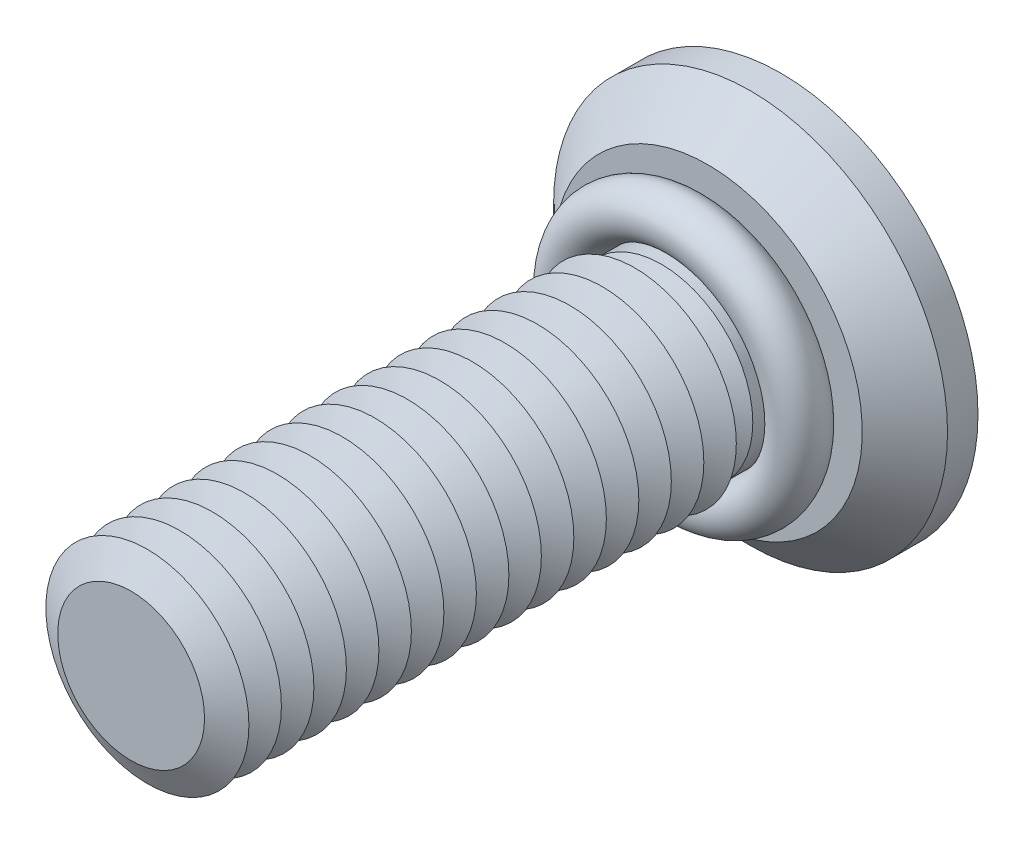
ISO-10303-21;
HEADER;
FILE_DESCRIPTION(('STEP AP214'),'2;1');
FILE_NAME('part.step','',(''),(''),'','','');
FILE_SCHEMA(('AUTOMOTIVE_DESIGN { 1 0 10303 214 1 1 1 1 }'));
ENDSEC;
DATA;
#1=APPLICATION_CONTEXT('core data for automotive mechanical design processes');
#2=APPLICATION_PROTOCOL_DEFINITION('international standard','automotive_design',2000,#1);
#3=PRODUCT_CONTEXT('',#1,'mechanical');
#4=PRODUCT('Part','Part','',(#3));
#5=PRODUCT_RELATED_PRODUCT_CATEGORY('part','',(#4));
#6=PRODUCT_DEFINITION_FORMATION('','',#4);
#7=PRODUCT_DEFINITION_CONTEXT('part definition',#1,'design');
#8=PRODUCT_DEFINITION('design','',#6,#7);
#9=PRODUCT_DEFINITION_SHAPE('','',#8);
#10=(LENGTH_UNIT() NAMED_UNIT(*) SI_UNIT(.MILLI.,.METRE.));
#11=(NAMED_UNIT(*) PLANE_ANGLE_UNIT() SI_UNIT($,.RADIAN.));
#12=(NAMED_UNIT(*) SI_UNIT($,.STERADIAN.) SOLID_ANGLE_UNIT());
#13=UNCERTAINTY_MEASURE_WITH_UNIT(LENGTH_MEASURE(1.E-05),#10,'distance_accuracy_value','');
#14=(GEOMETRIC_REPRESENTATION_CONTEXT(3) GLOBAL_UNCERTAINTY_ASSIGNED_CONTEXT((#13)) GLOBAL_UNIT_ASSIGNED_CONTEXT((#10,
#11,#12)) REPRESENTATION_CONTEXT('',''));
#15=CARTESIAN_POINT('',(0.,0.,0.));
#16=DIRECTION('',(0.,0.,1.));
#17=DIRECTION('',(1.,0.,0.));
#18=AXIS2_PLACEMENT_3D('',#15,#16,#17);
#19=CARTESIAN_POINT('',(0.,0.,2.4));
#20=DIRECTION('',(0.,0.,1.));
#21=DIRECTION('',(1.,0.,0.));
#22=AXIS2_PLACEMENT_3D('',#19,#20,#21);
#23=TOROIDAL_SURFACE('',#22,2.85,0.6);
#24=CARTESIAN_POINT('',(0.,2.85,2.4));
#25=DIRECTION('',(1.,0.,0.));
#26=DIRECTION('',(0.,0.,-1.));
#27=AXIS2_PLACEMENT_3D('',#24,#25,#26);
#28=CIRCLE('',#27,0.6);
#29=CARTESIAN_POINT('',(0.,3.45,2.4));
#30=VERTEX_POINT('',#29);
#31=EDGE_CURVE('P0_E10',#30,#30,#28,.T.);
#32=CARTESIAN_POINT('',(0.,0.,2.4));
#33=DIRECTION('',(0.,0.,1.));
#34=DIRECTION('',(1.,0.,0.));
#35=AXIS2_PLACEMENT_3D('',#32,#33,#34);
#36=CIRCLE('',#35,3.45);
#37=EDGE_CURVE('',#30,#30,#36,.T.);
#38=ORIENTED_EDGE('',*,*,#31,.F.);
#39=ORIENTED_EDGE('',*,*,#31,.T.);
#40=ORIENTED_EDGE('',*,*,#37,.T.);
#41=ORIENTED_EDGE('',*,*,#37,.F.);
#42=EDGE_LOOP('',(#38,#40,#39,#41));
#43=FACE_BOUND('',#42,.T.);
#44=ADVANCED_FACE('P0_F14',(#43),#23,.T.);
#45=CLOSED_SHELL('',(#44));
#46=MANIFOLD_SOLID_BREP('P0_B1',#45);
#47=CARTESIAN_POINT('',(0.,0.,12.));
#48=DIRECTION('',(0.,0.,-1.));
#49=DIRECTION('',(-1.,0.,0.));
#50=AXIS2_PLACEMENT_3D('',#47,#48,#49);
#51=CONICAL_SURFACE('',#50,1.80717967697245,1.0471975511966);
#52=CARTESIAN_POINT('',(0.,0.,11.6));
#53=DIRECTION('',(0.,0.,1.));
#54=DIRECTION('',(1.,0.,0.));
#55=AXIS2_PLACEMENT_3D('',#52,#53,#54);
#56=CIRCLE('',#55,2.5);
#57=CARTESIAN_POINT('',(2.5,0.,11.6));
#58=VERTEX_POINT('',#57);
#59=EDGE_CURVE('P1_E324',#58,#58,#56,.T.);
#60=ORIENTED_EDGE('',*,*,#59,.T.);
#61=EDGE_LOOP('',(#60));
#62=FACE_BOUND('',#61,.T.);
#63=CARTESIAN_POINT('',(0.,0.,12.));
#64=DIRECTION('',(0.,0.,1.));
#65=DIRECTION('',(1.,0.,0.));
#66=AXIS2_PLACEMENT_3D('',#63,#64,#65);
#67=CIRCLE('',#66,1.80717967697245);
#68=CARTESIAN_POINT('',(1.80717967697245,0.,12.));
#69=VERTEX_POINT('',#68);
#70=EDGE_CURVE('P1_E321',#69,#69,#67,.T.);
#71=ORIENTED_EDGE('',*,*,#70,.F.);
#72=EDGE_LOOP('',(#71));
#73=FACE_BOUND('',#72,.T.);
#74=ADVANCED_FACE('P1_F15',(#62,#73),#51,.T.);
#75=CARTESIAN_POINT('',(0.,0.,12.4));
#76=DIRECTION('',(0.,0.,1.));
#77=DIRECTION('',(1.,0.,0.));
#78=AXIS2_PLACEMENT_3D('',#75,#76,#77);
#79=CONICAL_SURFACE('',#78,2.5,1.0471975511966);
#80=ORIENTED_EDGE('',*,*,#70,.T.);
#81=EDGE_LOOP('',(#80));
#82=FACE_BOUND('',#81,.T.);
#83=CARTESIAN_POINT('',(0.,0.,12.4));
#84=DIRECTION('',(0.,0.,1.));
#85=DIRECTION('',(1.,0.,0.));
#86=AXIS2_PLACEMENT_3D('',#83,#84,#85);
#87=CIRCLE('',#86,2.5);
#88=CARTESIAN_POINT('',(2.5,0.,12.4));
#89=VERTEX_POINT('',#88);
#90=EDGE_CURVE('P1_E318',#89,#89,#87,.T.);
#91=ORIENTED_EDGE('',*,*,#90,.F.);
#92=EDGE_LOOP('',(#91));
#93=FACE_BOUND('',#92,.T.);
#94=ADVANCED_FACE('P1_F245',(#82,#93),#79,.T.);
#95=CARTESIAN_POINT('',(0.,0.,16.));
#96=DIRECTION('',(0.,0.,1.));
#97=DIRECTION('',(1.,0.,0.));
#98=AXIS2_PLACEMENT_3D('',#95,#96,#97);
#99=PLANE('',#98);
#100=CARTESIAN_POINT('',(0.,0.,16.));
#101=DIRECTION('',(0.,0.,1.));
#102=DIRECTION('',(1.,0.,0.));
#103=AXIS2_PLACEMENT_3D('',#100,#101,#102);
#104=CIRCLE('',#103,1.80717967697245);
#105=CARTESIAN_POINT('',(1.80717967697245,0.,16.));
#106=VERTEX_POINT('',#105);
#107=EDGE_CURVE('P1_E131',#106,#106,#104,.T.);
#108=ORIENTED_EDGE('',*,*,#107,.T.);
#109=EDGE_LOOP('',(#108));
#110=FACE_BOUND('',#109,.T.);
#111=ADVANCED_FACE('P1_F251',(#110),#99,.T.);
#112=CARTESIAN_POINT('',(0.,0.,16.));
#113=DIRECTION('',(0.,0.,-1.));
#114=DIRECTION('',(-1.,0.,0.));
#115=AXIS2_PLACEMENT_3D('',#112,#113,#114);
#116=CONICAL_SURFACE('',#115,1.80717967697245,1.0471975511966);
#117=CARTESIAN_POINT('',(0.,0.,15.6));
#118=DIRECTION('',(0.,0.,1.));
#119=DIRECTION('',(1.,0.,0.));
#120=AXIS2_PLACEMENT_3D('',#117,#118,#119);
#121=CIRCLE('',#120,2.5);
#122=CARTESIAN_POINT('',(2.5,0.,15.6));
#123=VERTEX_POINT('',#122);
#124=EDGE_CURVE('P1_E133',#123,#123,#121,.T.);
#125=ORIENTED_EDGE('',*,*,#124,.T.);
#126=EDGE_LOOP('',(#125));
#127=FACE_BOUND('',#126,.T.);
#128=ORIENTED_EDGE('',*,*,#107,.F.);
#129=EDGE_LOOP('',(#128));
#130=FACE_BOUND('',#129,.T.);
#131=ADVANCED_FACE('P1_F196',(#127,#130),#116,.T.);
#132=CARTESIAN_POINT('',(0.,0.,15.6));
#133=DIRECTION('',(0.,0.,1.));
#134=DIRECTION('',(1.,0.,0.));
#135=AXIS2_PLACEMENT_3D('',#132,#133,#134);
#136=CONICAL_SURFACE('',#135,2.5,1.0471975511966);
#137=CARTESIAN_POINT('',(0.,0.,15.2));
#138=DIRECTION('',(0.,0.,1.));
#139=DIRECTION('',(1.,0.,0.));
#140=AXIS2_PLACEMENT_3D('',#137,#138,#139);
#141=CIRCLE('',#140,1.80717967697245);
#142=CARTESIAN_POINT('',(1.80717967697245,0.,15.2));
#143=VERTEX_POINT('',#142);
#144=EDGE_CURVE('P1_E297',#143,#143,#141,.T.);
#145=ORIENTED_EDGE('',*,*,#144,.T.);
#146=EDGE_LOOP('',(#145));
#147=FACE_BOUND('',#146,.T.);
#148=ORIENTED_EDGE('',*,*,#124,.F.);
#149=EDGE_LOOP('',(#148));
#150=FACE_BOUND('',#149,.T.);
#151=ADVANCED_FACE('P1_F284',(#147,#150),#136,.T.);
#152=CARTESIAN_POINT('',(0.,0.,15.2));
#153=DIRECTION('',(0.,0.,-1.));
#154=DIRECTION('',(-1.,0.,0.));
#155=AXIS2_PLACEMENT_3D('',#152,#153,#154);
#156=CONICAL_SURFACE('',#155,1.80717967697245,1.0471975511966);
#157=CARTESIAN_POINT('',(0.,0.,14.8));
#158=DIRECTION('',(0.,0.,1.));
#159=DIRECTION('',(1.,0.,0.));
#160=AXIS2_PLACEMENT_3D('',#157,#158,#159);
#161=CIRCLE('',#160,2.5);
#162=CARTESIAN_POINT('',(2.5,0.,14.8));
#163=VERTEX_POINT('',#162);
#164=EDGE_CURVE('P1_E294',#163,#163,#161,.T.);
#165=ORIENTED_EDGE('',*,*,#164,.T.);
#166=EDGE_LOOP('',(#165));
#167=FACE_BOUND('',#166,.T.);
#168=ORIENTED_EDGE('',*,*,#144,.F.);
#169=EDGE_LOOP('',(#168));
#170=FACE_BOUND('',#169,.T.);
#171=ADVANCED_FACE('P1_F279',(#167,#170),#156,.T.);
#172=CARTESIAN_POINT('',(0.,0.,14.8));
#173=DIRECTION('',(0.,0.,1.));
#174=DIRECTION('',(1.,0.,0.));
#175=AXIS2_PLACEMENT_3D('',#172,#173,#174);
#176=CONICAL_SURFACE('',#175,2.5,1.0471975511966);
#177=CARTESIAN_POINT('',(0.,0.,14.4));
#178=DIRECTION('',(0.,0.,1.));
#179=DIRECTION('',(1.,0.,0.));
#180=AXIS2_PLACEMENT_3D('',#177,#178,#179);
#181=CIRCLE('',#180,1.80717967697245);
#182=CARTESIAN_POINT('',(1.80717967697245,0.,14.4));
#183=VERTEX_POINT('',#182);
#184=EDGE_CURVE('P1_E301',#183,#183,#181,.T.);
#185=ORIENTED_EDGE('',*,*,#184,.T.);
#186=EDGE_LOOP('',(#185));
#187=FACE_BOUND('',#186,.T.);
#188=ORIENTED_EDGE('',*,*,#164,.F.);
#189=EDGE_LOOP('',(#188));
#190=FACE_BOUND('',#189,.T.);
#191=ADVANCED_FACE('P1_F276',(#187,#190),#176,.T.);
#192=CARTESIAN_POINT('',(0.,0.,14.4));
#193=DIRECTION('',(0.,0.,-1.));
#194=DIRECTION('',(-1.,0.,0.));
#195=AXIS2_PLACEMENT_3D('',#192,#193,#194);
#196=CONICAL_SURFACE('',#195,1.80717967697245,1.0471975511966);
#197=CARTESIAN_POINT('',(0.,0.,14.));
#198=DIRECTION('',(0.,0.,1.));
#199=DIRECTION('',(1.,0.,0.));
#200=AXIS2_PLACEMENT_3D('',#197,#198,#199);
#201=CIRCLE('',#200,2.5);
#202=CARTESIAN_POINT('',(2.5,0.,14.));
#203=VERTEX_POINT('',#202);
#204=EDGE_CURVE('P1_E306',#203,#203,#201,.T.);
#205=ORIENTED_EDGE('',*,*,#204,.T.);
#206=EDGE_LOOP('',(#205));
#207=FACE_BOUND('',#206,.T.);
#208=ORIENTED_EDGE('',*,*,#184,.F.);
#209=EDGE_LOOP('',(#208));
#210=FACE_BOUND('',#209,.T.);
#211=ADVANCED_FACE('P1_F271',(#207,#210),#196,.T.);
#212=CARTESIAN_POINT('',(0.,0.,14.));
#213=DIRECTION('',(0.,0.,1.));
#214=DIRECTION('',(1.,0.,0.));
#215=AXIS2_PLACEMENT_3D('',#212,#213,#214);
#216=CONICAL_SURFACE('',#215,2.5,1.0471975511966);
#217=CARTESIAN_POINT('',(0.,0.,13.6));
#218=DIRECTION('',(0.,0.,1.));
#219=DIRECTION('',(1.,0.,0.));
#220=AXIS2_PLACEMENT_3D('',#217,#218,#219);
#221=CIRCLE('',#220,1.80717967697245);
#222=CARTESIAN_POINT('',(1.80717967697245,0.,13.6));
#223=VERTEX_POINT('',#222);
#224=EDGE_CURVE('P1_E309',#223,#223,#221,.T.);
#225=ORIENTED_EDGE('',*,*,#224,.T.);
#226=EDGE_LOOP('',(#225));
#227=FACE_BOUND('',#226,.T.);
#228=ORIENTED_EDGE('',*,*,#204,.F.);
#229=EDGE_LOOP('',(#228));
#230=FACE_BOUND('',#229,.T.);
#231=ADVANCED_FACE('P1_F268',(#227,#230),#216,.T.);
#232=CARTESIAN_POINT('',(0.,0.,13.6));
#233=DIRECTION('',(0.,0.,-1.));
#234=DIRECTION('',(-1.,0.,0.));
#235=AXIS2_PLACEMENT_3D('',#232,#233,#234);
#236=CONICAL_SURFACE('',#235,1.80717967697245,1.0471975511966);
#237=CARTESIAN_POINT('',(0.,0.,13.2));
#238=DIRECTION('',(0.,0.,1.));
#239=DIRECTION('',(1.,0.,0.));
#240=AXIS2_PLACEMENT_3D('',#237,#238,#239);
#241=CIRCLE('',#240,2.5);
#242=CARTESIAN_POINT('',(2.5,0.,13.2));
#243=VERTEX_POINT('',#242);
#244=EDGE_CURVE('P1_E312',#243,#243,#241,.T.);
#245=ORIENTED_EDGE('',*,*,#244,.T.);
#246=EDGE_LOOP('',(#245));
#247=FACE_BOUND('',#246,.T.);
#248=ORIENTED_EDGE('',*,*,#224,.F.);
#249=EDGE_LOOP('',(#248));
#250=FACE_BOUND('',#249,.T.);
#251=ADVANCED_FACE('P1_F262',(#247,#250),#236,.T.);
#252=CARTESIAN_POINT('',(0.,0.,13.2));
#253=DIRECTION('',(0.,0.,1.));
#254=DIRECTION('',(1.,0.,0.));
#255=AXIS2_PLACEMENT_3D('',#252,#253,#254);
#256=CONICAL_SURFACE('',#255,2.5,1.0471975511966);
#257=CARTESIAN_POINT('',(0.,0.,12.8));
#258=DIRECTION('',(0.,0.,1.));
#259=DIRECTION('',(1.,0.,0.));
#260=AXIS2_PLACEMENT_3D('',#257,#258,#259);
#261=CIRCLE('',#260,1.80717967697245);
#262=CARTESIAN_POINT('',(1.80717967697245,0.,12.8));
#263=VERTEX_POINT('',#262);
#264=EDGE_CURVE('P1_E315',#263,#263,#261,.T.);
#265=ORIENTED_EDGE('',*,*,#264,.T.);
#266=EDGE_LOOP('',(#265));
#267=FACE_BOUND('',#266,.T.);
#268=ORIENTED_EDGE('',*,*,#244,.F.);
#269=EDGE_LOOP('',(#268));
#270=FACE_BOUND('',#269,.T.);
#271=ADVANCED_FACE('P1_F258',(#267,#270),#256,.T.);
#272=CARTESIAN_POINT('',(0.,0.,12.8));
#273=DIRECTION('',(0.,0.,-1.));
#274=DIRECTION('',(-1.,0.,0.));
#275=AXIS2_PLACEMENT_3D('',#272,#273,#274);
#276=CONICAL_SURFACE('',#275,1.80717967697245,1.0471975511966);
#277=ORIENTED_EDGE('',*,*,#90,.T.);
#278=EDGE_LOOP('',(#277));
#279=FACE_BOUND('',#278,.T.);
#280=ORIENTED_EDGE('',*,*,#264,.F.);
#281=EDGE_LOOP('',(#280));
#282=FACE_BOUND('',#281,.T.);
#283=ADVANCED_FACE('P1_F261',(#279,#282),#276,.T.);
#284=CARTESIAN_POINT('',(0.,0.,11.2));
#285=DIRECTION('',(0.,0.,-1.));
#286=DIRECTION('',(-1.,0.,0.));
#287=AXIS2_PLACEMENT_3D('',#284,#285,#286);
#288=CONICAL_SURFACE('',#287,1.80717967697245,1.0471975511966);
#289=CARTESIAN_POINT('',(0.,0.,10.8));
#290=DIRECTION('',(0.,0.,1.));
#291=DIRECTION('',(1.,0.,0.));
#292=AXIS2_PLACEMENT_3D('',#289,#290,#291);
#293=CIRCLE('',#292,2.5);
#294=CARTESIAN_POINT('',(2.5,0.,10.8));
#295=VERTEX_POINT('',#294);
#296=EDGE_CURVE('P1_E329',#295,#295,#293,.T.);
#297=ORIENTED_EDGE('',*,*,#296,.T.);
#298=EDGE_LOOP('',(#297));
#299=FACE_BOUND('',#298,.T.);
#300=CARTESIAN_POINT('',(0.,0.,11.2));
#301=DIRECTION('',(0.,0.,1.));
#302=DIRECTION('',(1.,0.,0.));
#303=AXIS2_PLACEMENT_3D('',#300,#301,#302);
#304=CIRCLE('',#303,1.80717967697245);
#305=CARTESIAN_POINT('',(1.80717967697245,0.,11.2));
#306=VERTEX_POINT('',#305);
#307=EDGE_CURVE('P1_E326',#306,#306,#304,.T.);
#308=ORIENTED_EDGE('',*,*,#307,.F.);
#309=EDGE_LOOP('',(#308));
#310=FACE_BOUND('',#309,.T.);
#311=ADVANCED_FACE('P1_F266',(#299,#310),#288,.T.);
#312=CARTESIAN_POINT('',(0.,0.,11.6));
#313=DIRECTION('',(0.,0.,1.));
#314=DIRECTION('',(1.,0.,0.));
#315=AXIS2_PLACEMENT_3D('',#312,#313,#314);
#316=CONICAL_SURFACE('',#315,2.5,1.0471975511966);
#317=ORIENTED_EDGE('',*,*,#307,.T.);
#318=EDGE_LOOP('',(#317));
#319=FACE_BOUND('',#318,.T.);
#320=ORIENTED_EDGE('',*,*,#59,.F.);
#321=EDGE_LOOP('',(#320));
#322=FACE_BOUND('',#321,.T.);
#323=ADVANCED_FACE('P1_F492',(#319,#322),#316,.T.);
#324=CARTESIAN_POINT('',(0.,0.,10.4));
#325=DIRECTION('',(0.,0.,-1.));
#326=DIRECTION('',(-1.,0.,0.));
#327=AXIS2_PLACEMENT_3D('',#324,#325,#326);
#328=CONICAL_SURFACE('',#327,1.80717967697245,1.0471975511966);
#329=CARTESIAN_POINT('',(0.,0.,10.));
#330=DIRECTION('',(0.,0.,1.));
#331=DIRECTION('',(1.,0.,0.));
#332=AXIS2_PLACEMENT_3D('',#329,#330,#331);
#333=CIRCLE('',#332,2.5);
#334=CARTESIAN_POINT('',(2.5,0.,10.));
#335=VERTEX_POINT('',#334);
#336=EDGE_CURVE('P1_E335',#335,#335,#333,.T.);
#337=ORIENTED_EDGE('',*,*,#336,.T.);
#338=EDGE_LOOP('',(#337));
#339=FACE_BOUND('',#338,.T.);
#340=CARTESIAN_POINT('',(0.,0.,10.4));
#341=DIRECTION('',(0.,0.,1.));
#342=DIRECTION('',(1.,0.,0.));
#343=AXIS2_PLACEMENT_3D('',#340,#341,#342);
#344=CIRCLE('',#343,1.80717967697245);
#345=CARTESIAN_POINT('',(1.80717967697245,0.,10.4));
#346=VERTEX_POINT('',#345);
#347=EDGE_CURVE('P1_E332',#346,#346,#344,.T.);
#348=ORIENTED_EDGE('',*,*,#347,.F.);
#349=EDGE_LOOP('',(#348));
#350=FACE_BOUND('',#349,.T.);
#351=ADVANCED_FACE('P1_F502',(#339,#350),#328,.T.);
#352=CARTESIAN_POINT('',(0.,0.,10.8));
#353=DIRECTION('',(0.,0.,1.));
#354=DIRECTION('',(1.,0.,0.));
#355=AXIS2_PLACEMENT_3D('',#352,#353,#354);
#356=CONICAL_SURFACE('',#355,2.5,1.0471975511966);
#357=ORIENTED_EDGE('',*,*,#347,.T.);
#358=EDGE_LOOP('',(#357));
#359=FACE_BOUND('',#358,.T.);
#360=ORIENTED_EDGE('',*,*,#296,.F.);
#361=EDGE_LOOP('',(#360));
#362=FACE_BOUND('',#361,.T.);
#363=ADVANCED_FACE('P1_F512',(#359,#362),#356,.T.);
#364=CARTESIAN_POINT('',(0.,0.,9.6));
#365=DIRECTION('',(0.,0.,-1.));
#366=DIRECTION('',(-1.,0.,0.));
#367=AXIS2_PLACEMENT_3D('',#364,#365,#366);
#368=CONICAL_SURFACE('',#367,1.80717967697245,1.0471975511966);
#369=CARTESIAN_POINT('',(0.,0.,9.2));
#370=DIRECTION('',(0.,0.,1.));
#371=DIRECTION('',(1.,0.,0.));
#372=AXIS2_PLACEMENT_3D('',#369,#370,#371);
#373=CIRCLE('',#372,2.5);
#374=CARTESIAN_POINT('',(2.5,0.,9.2));
#375=VERTEX_POINT('',#374);
#376=EDGE_CURVE('P1_E341',#375,#375,#373,.T.);
#377=ORIENTED_EDGE('',*,*,#376,.T.);
#378=EDGE_LOOP('',(#377));
#379=FACE_BOUND('',#378,.T.);
#380=CARTESIAN_POINT('',(0.,0.,9.6));
#381=DIRECTION('',(0.,0.,1.));
#382=DIRECTION('',(1.,0.,0.));
#383=AXIS2_PLACEMENT_3D('',#380,#381,#382);
#384=CIRCLE('',#383,1.80717967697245);
#385=CARTESIAN_POINT('',(1.80717967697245,0.,9.6));
#386=VERTEX_POINT('',#385);
#387=EDGE_CURVE('P1_E338',#386,#386,#384,.T.);
#388=ORIENTED_EDGE('',*,*,#387,.F.);
#389=EDGE_LOOP('',(#388));
#390=FACE_BOUND('',#389,.T.);
#391=ADVANCED_FACE('P1_F522',(#379,#390),#368,.T.);
#392=CARTESIAN_POINT('',(0.,0.,10.));
#393=DIRECTION('',(0.,0.,1.));
#394=DIRECTION('',(1.,0.,0.));
#395=AXIS2_PLACEMENT_3D('',#392,#393,#394);
#396=CONICAL_SURFACE('',#395,2.5,1.0471975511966);
#397=ORIENTED_EDGE('',*,*,#387,.T.);
#398=EDGE_LOOP('',(#397));
#399=FACE_BOUND('',#398,.T.);
#400=ORIENTED_EDGE('',*,*,#336,.F.);
#401=EDGE_LOOP('',(#400));
#402=FACE_BOUND('',#401,.T.);
#403=ADVANCED_FACE('P1_F532',(#399,#402),#396,.T.);
#404=CARTESIAN_POINT('',(0.,0.,8.8));
#405=DIRECTION('',(0.,0.,-1.));
#406=DIRECTION('',(-1.,0.,0.));
#407=AXIS2_PLACEMENT_3D('',#404,#405,#406);
#408=CONICAL_SURFACE('',#407,1.80717967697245,1.0471975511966);
#409=CARTESIAN_POINT('',(0.,0.,8.4));
#410=DIRECTION('',(0.,0.,1.));
#411=DIRECTION('',(1.,0.,0.));
#412=AXIS2_PLACEMENT_3D('',#409,#410,#411);
#413=CIRCLE('',#412,2.5);
#414=CARTESIAN_POINT('',(2.5,0.,8.4));
#415=VERTEX_POINT('',#414);
#416=EDGE_CURVE('P1_E347',#415,#415,#413,.T.);
#417=ORIENTED_EDGE('',*,*,#416,.T.);
#418=EDGE_LOOP('',(#417));
#419=FACE_BOUND('',#418,.T.);
#420=CARTESIAN_POINT('',(0.,0.,8.8));
#421=DIRECTION('',(0.,0.,1.));
#422=DIRECTION('',(1.,0.,0.));
#423=AXIS2_PLACEMENT_3D('',#420,#421,#422);
#424=CIRCLE('',#423,1.80717967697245);
#425=CARTESIAN_POINT('',(1.80717967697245,0.,8.8));
#426=VERTEX_POINT('',#425);
#427=EDGE_CURVE('P1_E344',#426,#426,#424,.T.);
#428=ORIENTED_EDGE('',*,*,#427,.F.);
#429=EDGE_LOOP('',(#428));
#430=FACE_BOUND('',#429,.T.);
#431=ADVANCED_FACE('P1_F542',(#419,#430),#408,.T.);
#432=CARTESIAN_POINT('',(0.,0.,9.2));
#433=DIRECTION('',(0.,0.,1.));
#434=DIRECTION('',(1.,0.,0.));
#435=AXIS2_PLACEMENT_3D('',#432,#433,#434);
#436=CONICAL_SURFACE('',#435,2.5,1.0471975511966);
#437=ORIENTED_EDGE('',*,*,#427,.T.);
#438=EDGE_LOOP('',(#437));
#439=FACE_BOUND('',#438,.T.);
#440=ORIENTED_EDGE('',*,*,#376,.F.);
#441=EDGE_LOOP('',(#440));
#442=FACE_BOUND('',#441,.T.);
#443=ADVANCED_FACE('P1_F552',(#439,#442),#436,.T.);
#444=CARTESIAN_POINT('',(0.,0.,8.));
#445=DIRECTION('',(0.,0.,-1.));
#446=DIRECTION('',(-1.,0.,0.));
#447=AXIS2_PLACEMENT_3D('',#444,#445,#446);
#448=CONICAL_SURFACE('',#447,1.80717967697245,1.0471975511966);
#449=CARTESIAN_POINT('',(0.,0.,7.6));
#450=DIRECTION('',(0.,0.,1.));
#451=DIRECTION('',(1.,0.,0.));
#452=AXIS2_PLACEMENT_3D('',#449,#450,#451);
#453=CIRCLE('',#452,2.5);
#454=CARTESIAN_POINT('',(2.5,0.,7.6));
#455=VERTEX_POINT('',#454);
#456=EDGE_CURVE('P1_E353',#455,#455,#453,.T.);
#457=ORIENTED_EDGE('',*,*,#456,.T.);
#458=EDGE_LOOP('',(#457));
#459=FACE_BOUND('',#458,.T.);
#460=CARTESIAN_POINT('',(0.,0.,8.));
#461=DIRECTION('',(0.,0.,1.));
#462=DIRECTION('',(1.,0.,0.));
#463=AXIS2_PLACEMENT_3D('',#460,#461,#462);
#464=CIRCLE('',#463,1.80717967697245);
#465=CARTESIAN_POINT('',(1.80717967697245,0.,8.));
#466=VERTEX_POINT('',#465);
#467=EDGE_CURVE('P1_E350',#466,#466,#464,.T.);
#468=ORIENTED_EDGE('',*,*,#467,.F.);
#469=EDGE_LOOP('',(#468));
#470=FACE_BOUND('',#469,.T.);
#471=ADVANCED_FACE('P1_F562',(#459,#470),#448,.T.);
#472=CARTESIAN_POINT('',(0.,0.,8.4));
#473=DIRECTION('',(0.,0.,1.));
#474=DIRECTION('',(1.,0.,0.));
#475=AXIS2_PLACEMENT_3D('',#472,#473,#474);
#476=CONICAL_SURFACE('',#475,2.5,1.0471975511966);
#477=ORIENTED_EDGE('',*,*,#467,.T.);
#478=EDGE_LOOP('',(#477));
#479=FACE_BOUND('',#478,.T.);
#480=ORIENTED_EDGE('',*,*,#416,.F.);
#481=EDGE_LOOP('',(#480));
#482=FACE_BOUND('',#481,.T.);
#483=ADVANCED_FACE('P1_F572',(#479,#482),#476,.T.);
#484=CARTESIAN_POINT('',(0.,0.,7.2));
#485=DIRECTION('',(0.,0.,-1.));
#486=DIRECTION('',(-1.,0.,0.));
#487=AXIS2_PLACEMENT_3D('',#484,#485,#486);
#488=CONICAL_SURFACE('',#487,1.80717967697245,1.0471975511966);
#489=CARTESIAN_POINT('',(0.,0.,6.8));
#490=DIRECTION('',(0.,0.,1.));
#491=DIRECTION('',(1.,0.,0.));
#492=AXIS2_PLACEMENT_3D('',#489,#490,#491);
#493=CIRCLE('',#492,2.5);
#494=CARTESIAN_POINT('',(2.5,0.,6.8));
#495=VERTEX_POINT('',#494);
#496=EDGE_CURVE('P1_E359',#495,#495,#493,.T.);
#497=ORIENTED_EDGE('',*,*,#496,.T.);
#498=EDGE_LOOP('',(#497));
#499=FACE_BOUND('',#498,.T.);
#500=CARTESIAN_POINT('',(0.,0.,7.2));
#501=DIRECTION('',(0.,0.,1.));
#502=DIRECTION('',(1.,0.,0.));
#503=AXIS2_PLACEMENT_3D('',#500,#501,#502);
#504=CIRCLE('',#503,1.80717967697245);
#505=CARTESIAN_POINT('',(1.80717967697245,0.,7.2));
#506=VERTEX_POINT('',#505);
#507=EDGE_CURVE('P1_E356',#506,#506,#504,.T.);
#508=ORIENTED_EDGE('',*,*,#507,.F.);
#509=EDGE_LOOP('',(#508));
#510=FACE_BOUND('',#509,.T.);
#511=ADVANCED_FACE('P1_F582',(#499,#510),#488,.T.);
#512=CARTESIAN_POINT('',(0.,0.,7.6));
#513=DIRECTION('',(0.,0.,1.));
#514=DIRECTION('',(1.,0.,0.));
#515=AXIS2_PLACEMENT_3D('',#512,#513,#514);
#516=CONICAL_SURFACE('',#515,2.5,1.0471975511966);
#517=ORIENTED_EDGE('',*,*,#507,.T.);
#518=EDGE_LOOP('',(#517));
#519=FACE_BOUND('',#518,.T.);
#520=ORIENTED_EDGE('',*,*,#456,.F.);
#521=EDGE_LOOP('',(#520));
#522=FACE_BOUND('',#521,.T.);
#523=ADVANCED_FACE('P1_F592',(#519,#522),#516,.T.);
#524=CARTESIAN_POINT('',(0.,0.,6.4));
#525=DIRECTION('',(0.,0.,-1.));
#526=DIRECTION('',(-1.,0.,0.));
#527=AXIS2_PLACEMENT_3D('',#524,#525,#526);
#528=CONICAL_SURFACE('',#527,1.80717967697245,1.0471975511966);
#529=CARTESIAN_POINT('',(0.,0.,6.));
#530=DIRECTION('',(0.,0.,1.));
#531=DIRECTION('',(1.,0.,0.));
#532=AXIS2_PLACEMENT_3D('',#529,#530,#531);
#533=CIRCLE('',#532,2.5);
#534=CARTESIAN_POINT('',(2.5,0.,6.));
#535=VERTEX_POINT('',#534);
#536=EDGE_CURVE('P1_E365',#535,#535,#533,.T.);
#537=ORIENTED_EDGE('',*,*,#536,.T.);
#538=EDGE_LOOP('',(#537));
#539=FACE_BOUND('',#538,.T.);
#540=CARTESIAN_POINT('',(0.,0.,6.4));
#541=DIRECTION('',(0.,0.,1.));
#542=DIRECTION('',(1.,0.,0.));
#543=AXIS2_PLACEMENT_3D('',#540,#541,#542);
#544=CIRCLE('',#543,1.80717967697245);
#545=CARTESIAN_POINT('',(1.80717967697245,0.,6.4));
#546=VERTEX_POINT('',#545);
#547=EDGE_CURVE('P1_E362',#546,#546,#544,.T.);
#548=ORIENTED_EDGE('',*,*,#547,.F.);
#549=EDGE_LOOP('',(#548));
#550=FACE_BOUND('',#549,.T.);
#551=ADVANCED_FACE('P1_F602',(#539,#550),#528,.T.);
#552=CARTESIAN_POINT('',(0.,0.,6.8));
#553=DIRECTION('',(0.,0.,1.));
#554=DIRECTION('',(1.,0.,0.));
#555=AXIS2_PLACEMENT_3D('',#552,#553,#554);
#556=CONICAL_SURFACE('',#555,2.5,1.0471975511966);
#557=ORIENTED_EDGE('',*,*,#547,.T.);
#558=EDGE_LOOP('',(#557));
#559=FACE_BOUND('',#558,.T.);
#560=ORIENTED_EDGE('',*,*,#496,.F.);
#561=EDGE_LOOP('',(#560));
#562=FACE_BOUND('',#561,.T.);
#563=ADVANCED_FACE('P1_F612',(#559,#562),#556,.T.);
#564=CARTESIAN_POINT('',(0.,0.,5.6));
#565=DIRECTION('',(0.,0.,-1.));
#566=DIRECTION('',(-1.,0.,0.));
#567=AXIS2_PLACEMENT_3D('',#564,#565,#566);
#568=CONICAL_SURFACE('',#567,1.80717967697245,1.0471975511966);
#569=CARTESIAN_POINT('',(0.,0.,5.2));
#570=DIRECTION('',(0.,0.,1.));
#571=DIRECTION('',(1.,0.,0.));
#572=AXIS2_PLACEMENT_3D('',#569,#570,#571);
#573=CIRCLE('',#572,2.5);
#574=CARTESIAN_POINT('',(2.5,0.,5.2));
#575=VERTEX_POINT('',#574);
#576=EDGE_CURVE('P1_E371',#575,#575,#573,.T.);
#577=ORIENTED_EDGE('',*,*,#576,.T.);
#578=EDGE_LOOP('',(#577));
#579=FACE_BOUND('',#578,.T.);
#580=CARTESIAN_POINT('',(0.,0.,5.6));
#581=DIRECTION('',(0.,0.,1.));
#582=DIRECTION('',(1.,0.,0.));
#583=AXIS2_PLACEMENT_3D('',#580,#581,#582);
#584=CIRCLE('',#583,1.80717967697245);
#585=CARTESIAN_POINT('',(1.80717967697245,0.,5.6));
#586=VERTEX_POINT('',#585);
#587=EDGE_CURVE('P1_E368',#586,#586,#584,.T.);
#588=ORIENTED_EDGE('',*,*,#587,.F.);
#589=EDGE_LOOP('',(#588));
#590=FACE_BOUND('',#589,.T.);
#591=ADVANCED_FACE('P1_F622',(#579,#590),#568,.T.);
#592=CARTESIAN_POINT('',(0.,0.,6.));
#593=DIRECTION('',(0.,0.,1.));
#594=DIRECTION('',(1.,0.,0.));
#595=AXIS2_PLACEMENT_3D('',#592,#593,#594);
#596=CONICAL_SURFACE('',#595,2.5,1.0471975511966);
#597=ORIENTED_EDGE('',*,*,#587,.T.);
#598=EDGE_LOOP('',(#597));
#599=FACE_BOUND('',#598,.T.);
#600=ORIENTED_EDGE('',*,*,#536,.F.);
#601=EDGE_LOOP('',(#600));
#602=FACE_BOUND('',#601,.T.);
#603=ADVANCED_FACE('P1_F632',(#599,#602),#596,.T.);
#604=CARTESIAN_POINT('',(0.,0.,4.8));
#605=DIRECTION('',(0.,0.,-1.));
#606=DIRECTION('',(-1.,0.,0.));
#607=AXIS2_PLACEMENT_3D('',#604,#605,#606);
#608=CONICAL_SURFACE('',#607,1.80717967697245,1.0471975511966);
#609=CARTESIAN_POINT('',(0.,0.,4.4));
#610=DIRECTION('',(0.,0.,1.));
#611=DIRECTION('',(1.,0.,0.));
#612=AXIS2_PLACEMENT_3D('',#609,#610,#611);
#613=CIRCLE('',#612,2.5);
#614=CARTESIAN_POINT('',(2.5,0.,4.4));
#615=VERTEX_POINT('',#614);
#616=EDGE_CURVE('P1_E377',#615,#615,#613,.T.);
#617=ORIENTED_EDGE('',*,*,#616,.T.);
#618=EDGE_LOOP('',(#617));
#619=FACE_BOUND('',#618,.T.);
#620=CARTESIAN_POINT('',(0.,0.,4.8));
#621=DIRECTION('',(0.,0.,1.));
#622=DIRECTION('',(1.,0.,0.));
#623=AXIS2_PLACEMENT_3D('',#620,#621,#622);
#624=CIRCLE('',#623,1.80717967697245);
#625=CARTESIAN_POINT('',(1.80717967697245,0.,4.8));
#626=VERTEX_POINT('',#625);
#627=EDGE_CURVE('P1_E374',#626,#626,#624,.T.);
#628=ORIENTED_EDGE('',*,*,#627,.F.);
#629=EDGE_LOOP('',(#628));
#630=FACE_BOUND('',#629,.T.);
#631=ADVANCED_FACE('P1_F642',(#619,#630),#608,.T.);
#632=CARTESIAN_POINT('',(0.,0.,5.2));
#633=DIRECTION('',(0.,0.,1.));
#634=DIRECTION('',(1.,0.,0.));
#635=AXIS2_PLACEMENT_3D('',#632,#633,#634);
#636=CONICAL_SURFACE('',#635,2.5,1.0471975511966);
#637=ORIENTED_EDGE('',*,*,#627,.T.);
#638=EDGE_LOOP('',(#637));
#639=FACE_BOUND('',#638,.T.);
#640=ORIENTED_EDGE('',*,*,#576,.F.);
#641=EDGE_LOOP('',(#640));
#642=FACE_BOUND('',#641,.T.);
#643=ADVANCED_FACE('P1_F652',(#639,#642),#636,.T.);
#644=CARTESIAN_POINT('',(0.,0.,4.));
#645=DIRECTION('',(0.,0.,-1.));
#646=DIRECTION('',(-1.,0.,0.));
#647=AXIS2_PLACEMENT_3D('',#644,#645,#646);
#648=CONICAL_SURFACE('',#647,1.80717967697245,1.0471975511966);
#649=CARTESIAN_POINT('',(0.,0.,3.6));
#650=DIRECTION('',(0.,0.,1.));
#651=DIRECTION('',(1.,0.,0.));
#652=AXIS2_PLACEMENT_3D('',#649,#650,#651);
#653=CIRCLE('',#652,2.5);
#654=CARTESIAN_POINT('',(2.5,0.,3.6));
#655=VERTEX_POINT('',#654);
#656=EDGE_CURVE('P1_E383',#655,#655,#653,.T.);
#657=ORIENTED_EDGE('',*,*,#656,.T.);
#658=EDGE_LOOP('',(#657));
#659=FACE_BOUND('',#658,.T.);
#660=CARTESIAN_POINT('',(0.,0.,4.));
#661=DIRECTION('',(0.,0.,1.));
#662=DIRECTION('',(1.,0.,0.));
#663=AXIS2_PLACEMENT_3D('',#660,#661,#662);
#664=CIRCLE('',#663,1.80717967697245);
#665=CARTESIAN_POINT('',(1.80717967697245,0.,4.));
#666=VERTEX_POINT('',#665);
#667=EDGE_CURVE('P1_E380',#666,#666,#664,.T.);
#668=ORIENTED_EDGE('',*,*,#667,.F.);
#669=EDGE_LOOP('',(#668));
#670=FACE_BOUND('',#669,.T.);
#671=ADVANCED_FACE('P1_F662',(#659,#670),#648,.T.);
#672=CARTESIAN_POINT('',(0.,0.,4.4));
#673=DIRECTION('',(0.,0.,1.));
#674=DIRECTION('',(1.,0.,0.));
#675=AXIS2_PLACEMENT_3D('',#672,#673,#674);
#676=CONICAL_SURFACE('',#675,2.5,1.0471975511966);
#677=ORIENTED_EDGE('',*,*,#667,.T.);
#678=EDGE_LOOP('',(#677));
#679=FACE_BOUND('',#678,.T.);
#680=ORIENTED_EDGE('',*,*,#616,.F.);
#681=EDGE_LOOP('',(#680));
#682=FACE_BOUND('',#681,.T.);
#683=ADVANCED_FACE('P1_F396',(#679,#682),#676,.T.);
#684=CARTESIAN_POINT('',(0.,0.,3.2));
#685=DIRECTION('',(0.,0.,-1.));
#686=DIRECTION('',(-1.,0.,0.));
#687=AXIS2_PLACEMENT_3D('',#684,#685,#686);
#688=CONICAL_SURFACE('',#687,1.80717967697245,1.0471975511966);
#689=CARTESIAN_POINT('',(0.,0.,3.2));
#690=DIRECTION('',(0.,0.,1.));
#691=DIRECTION('',(1.,0.,0.));
#692=AXIS2_PLACEMENT_3D('',#689,#690,#691);
#693=CIRCLE('',#692,1.80717967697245);
#694=CARTESIAN_POINT('',(1.80717967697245,0.,3.2));
#695=VERTEX_POINT('',#694);
#696=EDGE_CURVE('P1_E386',#695,#695,#693,.T.);
#697=ORIENTED_EDGE('',*,*,#696,.F.);
#698=EDGE_LOOP('',(#697));
#699=FACE_BOUND('',#698,.T.);
#700=CARTESIAN_POINT('',(0.,0.,2.94433756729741));
#701=DIRECTION('',(0.,0.,-1.));
#702=DIRECTION('',(-1.,0.,0.));
#703=AXIS2_PLACEMENT_3D('',#700,#701,#702);
#704=CIRCLE('',#703,2.25);
#705=CARTESIAN_POINT('',(-2.25,0.,2.94433756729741));
#706=VERTEX_POINT('',#705);
#707=EDGE_CURVE('P1_E19',#706,#706,#704,.F.);
#708=ORIENTED_EDGE('',*,*,#707,.T.);
#709=EDGE_LOOP('',(#708));
#710=FACE_BOUND('',#709,.T.);
#711=ADVANCED_FACE('P1_F393',(#699,#710),#688,.T.);
#712=CARTESIAN_POINT('',(0.,0.,3.6));
#713=DIRECTION('',(0.,0.,1.));
#714=DIRECTION('',(1.,0.,0.));
#715=AXIS2_PLACEMENT_3D('',#712,#713,#714);
#716=CONICAL_SURFACE('',#715,2.5,1.0471975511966);
#717=ORIENTED_EDGE('',*,*,#696,.T.);
#718=EDGE_LOOP('',(#717));
#719=FACE_BOUND('',#718,.T.);
#720=ORIENTED_EDGE('',*,*,#656,.F.);
#721=EDGE_LOOP('',(#720));
#722=FACE_BOUND('',#721,.T.);
#723=ADVANCED_FACE('P1_F390',(#719,#722),#716,.T.);
#724=CARTESIAN_POINT('',(0.,0.,2.));
#725=DIRECTION('',(0.,0.,-1.));
#726=DIRECTION('',(-1.,0.,0.));
#727=AXIS2_PLACEMENT_3D('',#724,#725,#726);
#728=CONICAL_SURFACE('',#727,1.5,1.0471975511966);
#729=CARTESIAN_POINT('',(0.,0.,2.86602540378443));
#730=VERTEX_POINT('',#729);
#731=VERTEX_LOOP('',#730);
#732=FACE_BOUND('',#731,.T.);
#733=CARTESIAN_POINT('',(0.,0.,2.));
#734=DIRECTION('',(0.,0.,-1.));
#735=DIRECTION('',(-1.,0.,0.));
#736=AXIS2_PLACEMENT_3D('',#733,#734,#735);
#737=CIRCLE('',#736,1.5);
#738=CARTESIAN_POINT('',(-1.5,0.,2.));
#739=VERTEX_POINT('',#738);
#740=CARTESIAN_POINT('',(-0.75,1.29903810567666,2.));
#741=VERTEX_POINT('',#740);
#742=EDGE_CURVE('P1_E117',#739,#741,#737,.T.);
#743=ORIENTED_EDGE('',*,*,#742,.T.);
#744=CARTESIAN_POINT('',(0.,0.,2.));
#745=DIRECTION('',(0.,0.,-1.));
#746=DIRECTION('',(-1.,0.,0.));
#747=AXIS2_PLACEMENT_3D('',#744,#745,#746);
#748=CIRCLE('',#747,1.5);
#749=CARTESIAN_POINT('',(0.75,1.29903810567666,2.));
#750=VERTEX_POINT('',#749);
#751=EDGE_CURVE('P1_E24',#741,#750,#748,.T.);
#752=ORIENTED_EDGE('',*,*,#751,.T.);
#753=CARTESIAN_POINT('',(1.5,0.,2.));
#754=VERTEX_POINT('',#753);
#755=EDGE_CURVE('P1_E895',#750,#754,#748,.T.);
#756=ORIENTED_EDGE('',*,*,#755,.T.);
#757=CARTESIAN_POINT('',(0.75,-1.29903810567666,2.));
#758=VERTEX_POINT('',#757);
#759=EDGE_CURVE('P1_E888',#754,#758,#748,.T.);
#760=ORIENTED_EDGE('',*,*,#759,.T.);
#761=CARTESIAN_POINT('',(-0.75,-1.29903810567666,2.));
#762=VERTEX_POINT('',#761);
#763=EDGE_CURVE('P1_E182',#758,#762,#748,.T.);
#764=ORIENTED_EDGE('',*,*,#763,.T.);
#765=EDGE_CURVE('P1_E179',#762,#739,#748,.T.);
#766=ORIENTED_EDGE('',*,*,#765,.T.);
#767=EDGE_LOOP('',(#743,#752,#756,#760,#764,#766));
#768=FACE_BOUND('',#767,.T.);
#769=ADVANCED_FACE('P1_F198',(#732,#768),#728,.F.);
#770=CARTESIAN_POINT('',(0.,0.,2.));
#771=DIRECTION('',(0.,0.,-1.));
#772=DIRECTION('',(-1.,0.,0.));
#773=AXIS2_PLACEMENT_3D('',#770,#771,#772);
#774=PLANE('',#773);
#775=ORIENTED_EDGE('',*,*,#763,.F.);
#776=DIRECTION('',(-0.866025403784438,-0.5,0.));
#777=VECTOR('',#776,1.);
#778=CARTESIAN_POINT('',(1.5,-0.866025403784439,2.));
#779=LINE('',#778,#777);
#780=CARTESIAN_POINT('',(0.,-1.73205080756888,2.));
#781=VERTEX_POINT('',#780);
#782=EDGE_CURVE('P1_E904',#758,#781,#779,.T.);
#783=ORIENTED_EDGE('',*,*,#782,.T.);
#784=DIRECTION('',(-0.866025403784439,0.5,0.));
#785=VECTOR('',#784,1.);
#786=CARTESIAN_POINT('',(0.,-1.73205080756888,2.));
#787=LINE('',#786,#785);
#788=EDGE_CURVE('P1_E911',#781,#762,#787,.T.);
#789=ORIENTED_EDGE('',*,*,#788,.T.);
#790=EDGE_LOOP('',(#775,#783,#789));
#791=FACE_BOUND('',#790,.T.);
#792=ADVANCED_FACE('P1_F703',(#791),#774,.T.);
#793=ORIENTED_EDGE('',*,*,#765,.F.);
#794=CARTESIAN_POINT('',(-1.5,-0.866025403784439,2.));
#795=VERTEX_POINT('',#794);
#796=EDGE_CURVE('P1_E914',#762,#795,#787,.T.);
#797=ORIENTED_EDGE('',*,*,#796,.T.);
#798=DIRECTION('',(0.,1.,0.));
#799=VECTOR('',#798,1.);
#800=CARTESIAN_POINT('',(-1.5,-0.866025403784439,2.));
#801=LINE('',#800,#799);
#802=EDGE_CURVE('P1_E123',#795,#739,#801,.T.);
#803=ORIENTED_EDGE('',*,*,#802,.T.);
#804=EDGE_LOOP('',(#793,#797,#803));
#805=FACE_BOUND('',#804,.T.);
#806=ADVANCED_FACE('P1_F231',(#805),#774,.T.);
#807=ORIENTED_EDGE('',*,*,#742,.F.);
#808=CARTESIAN_POINT('',(-1.5,0.866025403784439,2.));
#809=VERTEX_POINT('',#808);
#810=EDGE_CURVE('P1_E916',#739,#809,#801,.T.);
#811=ORIENTED_EDGE('',*,*,#810,.T.);
#812=DIRECTION('',(0.866025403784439,0.5,0.));
#813=VECTOR('',#812,1.);
#814=CARTESIAN_POINT('',(-1.5,0.866025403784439,2.));
#815=LINE('',#814,#813);
#816=EDGE_CURVE('P1_E919',#809,#741,#815,.T.);
#817=ORIENTED_EDGE('',*,*,#816,.T.);
#818=EDGE_LOOP('',(#807,#811,#817));
#819=FACE_BOUND('',#818,.T.);
#820=ADVANCED_FACE('P1_F721',(#819),#774,.T.);
#821=ORIENTED_EDGE('',*,*,#751,.F.);
#822=CARTESIAN_POINT('',(0.,1.73205080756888,2.));
#823=VERTEX_POINT('',#822);
#824=EDGE_CURVE('P1_E918',#741,#823,#815,.T.);
#825=ORIENTED_EDGE('',*,*,#824,.T.);
#826=DIRECTION('',(0.866025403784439,-0.5,0.));
#827=VECTOR('',#826,1.);
#828=CARTESIAN_POINT('',(0.,1.73205080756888,2.));
#829=LINE('',#828,#827);
#830=EDGE_CURVE('P1_E161',#823,#750,#829,.T.);
#831=ORIENTED_EDGE('',*,*,#830,.T.);
#832=EDGE_LOOP('',(#821,#825,#831));
#833=FACE_BOUND('',#832,.T.);
#834=ADVANCED_FACE('P1_F731',(#833),#774,.T.);
#835=ORIENTED_EDGE('',*,*,#755,.F.);
#836=CARTESIAN_POINT('',(1.5,0.866025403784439,2.));
#837=VERTEX_POINT('',#836);
#838=EDGE_CURVE('P1_E903',#750,#837,#829,.T.);
#839=ORIENTED_EDGE('',*,*,#838,.T.);
#840=DIRECTION('',(0.,-1.,0.));
#841=VECTOR('',#840,1.);
#842=CARTESIAN_POINT('',(1.5,0.866025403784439,2.));
#843=LINE('',#842,#841);
#844=EDGE_CURVE('P1_E898',#837,#754,#843,.T.);
#845=ORIENTED_EDGE('',*,*,#844,.T.);
#846=EDGE_LOOP('',(#835,#839,#845));
#847=FACE_BOUND('',#846,.T.);
#848=ADVANCED_FACE('P1_F741',(#847),#774,.T.);
#849=ORIENTED_EDGE('',*,*,#759,.F.);
#850=CARTESIAN_POINT('',(1.5,-0.866025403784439,2.));
#851=VERTEX_POINT('',#850);
#852=EDGE_CURVE('P1_E890',#754,#851,#843,.T.);
#853=ORIENTED_EDGE('',*,*,#852,.T.);
#854=EDGE_CURVE('P1_E125',#851,#758,#779,.T.);
#855=ORIENTED_EDGE('',*,*,#854,.T.);
#856=EDGE_LOOP('',(#849,#853,#855));
#857=FACE_BOUND('',#856,.T.);
#858=ADVANCED_FACE('P1_F229',(#857),#774,.T.);
#859=CARTESIAN_POINT('',(1.5,-0.866025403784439,2.));
#860=DIRECTION('',(0.5,-0.866025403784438,0.));
#861=DIRECTION('',(0.866025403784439,0.5,0.));
#862=AXIS2_PLACEMENT_3D('',#859,#860,#861);
#863=PLANE('',#862);
#864=DIRECTION('',(0.,0.,-1.));
#865=VECTOR('',#864,1.);
#866=CARTESIAN_POINT('',(1.5,-0.866025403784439,2.));
#867=LINE('',#866,#865);
#868=CARTESIAN_POINT('',(1.5,-0.866025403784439,0.));
#869=VERTEX_POINT('',#868);
#870=EDGE_CURVE('P1_E164',#851,#869,#867,.T.);
#871=ORIENTED_EDGE('',*,*,#870,.T.);
#872=CARTESIAN_POINT('',(1.5002,-0.865909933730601,-3.09432014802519E-05));
#873=CARTESIAN_POINT('',(1.43789222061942,-0.901883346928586,0.00961367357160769));
#874=CARTESIAN_POINT('',(1.37547144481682,-0.937921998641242,0.0183695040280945));
#875=CARTESIAN_POINT('',(1.25040937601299,-1.01012661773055,0.0337528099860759));
#876=CARTESIAN_POINT('',(1.18776800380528,-1.04629263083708,0.0403794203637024));
#877=CARTESIAN_POINT('',(1.06264466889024,-1.11853262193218,0.0511173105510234));
#878=CARTESIAN_POINT('',(1.00016355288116,-1.15460611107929,0.0552413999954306));
#879=CARTESIAN_POINT('',(0.875121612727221,-1.22679910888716,0.0607713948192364));
#880=CARTESIAN_POINT('',(0.812560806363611,-1.26291860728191,0.0621778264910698));
#881=CARTESIAN_POINT('',(0.68743919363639,-1.33515760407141,0.0621778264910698));
#882=CARTESIAN_POINT('',(0.624878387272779,-1.37127710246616,0.0607713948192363));
#883=CARTESIAN_POINT('',(0.499836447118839,-1.44347010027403,0.0552413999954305));
#884=CARTESIAN_POINT('',(0.437355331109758,-1.47954358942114,0.0511173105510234));
#885=CARTESIAN_POINT('',(0.312231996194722,-1.55178358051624,0.0403794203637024));
#886=CARTESIAN_POINT('',(0.249590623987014,-1.58794959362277,0.0337528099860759));
#887=CARTESIAN_POINT('',(0.124528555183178,-1.66015421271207,0.0183695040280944));
#888=CARTESIAN_POINT('',(0.0621077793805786,-1.69619286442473,0.00961367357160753));
#889=CARTESIAN_POINT('',(-0.000199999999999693,-1.73216627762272,-3.09432014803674E-05));
#890=B_SPLINE_CURVE_WITH_KNOTS('',3,(#872,#873,#874,#875,#876,#877,#878,#879,#880,#881,#882,
#883,#884,#885,#886,#887,#888,#889),.UNSPECIFIED.,.F.,.F.,(4,2,2,2,2,2,2,2,4),(0.,
0.217782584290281,0.435653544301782,0.652399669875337,0.869103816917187,1.08580796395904,
1.30255408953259,1.52042504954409,1.73820763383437),.UNSPECIFIED.);
#891=CARTESIAN_POINT('',(0.,-1.73205080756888,0.));
#892=VERTEX_POINT('',#891);
#893=EDGE_CURVE('P1_E118',#869,#892,#890,.T.);
#894=ORIENTED_EDGE('',*,*,#893,.T.);
#895=DIRECTION('',(0.,0.,-1.));
#896=VECTOR('',#895,1.);
#897=CARTESIAN_POINT('',(0.,-1.73205080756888,2.));
#898=LINE('',#897,#896);
#899=EDGE_CURVE('P1_E116',#781,#892,#898,.T.);
#900=ORIENTED_EDGE('',*,*,#899,.F.);
#901=ORIENTED_EDGE('',*,*,#782,.F.);
#902=ORIENTED_EDGE('',*,*,#854,.F.);
#903=EDGE_LOOP('',(#871,#894,#900,#901,#902));
#904=FACE_BOUND('',#903,.T.);
#905=ADVANCED_FACE('P1_F226',(#904),#863,.F.);
#906=CARTESIAN_POINT('',(0.,-1.73205080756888,2.));
#907=DIRECTION('',(-0.5,-0.866025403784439,0.));
#908=DIRECTION('',(0.866025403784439,-0.5,0.));
#909=AXIS2_PLACEMENT_3D('',#906,#907,#908);
#910=PLANE('',#909);
#911=ORIENTED_EDGE('',*,*,#899,.T.);
#912=CARTESIAN_POINT('',(0.000200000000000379,-1.73216627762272,-3.09432014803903E-05));
#913=CARTESIAN_POINT('',(-0.062107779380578,-1.69619286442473,0.00961367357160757));
#914=CARTESIAN_POINT('',(-0.124528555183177,-1.66015421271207,0.0183695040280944));
#915=CARTESIAN_POINT('',(-0.249590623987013,-1.58794959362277,0.0337528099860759));
#916=CARTESIAN_POINT('',(-0.312231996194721,-1.55178358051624,0.0403794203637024));
#917=CARTESIAN_POINT('',(-0.437355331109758,-1.47954358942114,0.0511173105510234));
#918=CARTESIAN_POINT('',(-0.499836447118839,-1.44347010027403,0.0552413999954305));
#919=CARTESIAN_POINT('',(-0.624878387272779,-1.37127710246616,0.0607713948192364));
#920=CARTESIAN_POINT('',(-0.687439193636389,-1.33515760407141,0.0621778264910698));
#921=CARTESIAN_POINT('',(-0.81256080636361,-1.26291860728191,0.0621778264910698));
#922=CARTESIAN_POINT('',(-0.87512161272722,-1.22679910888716,0.0607713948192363));
#923=CARTESIAN_POINT('',(-1.00016355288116,-1.15460611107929,0.0552413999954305));
#924=CARTESIAN_POINT('',(-1.06264466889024,-1.11853262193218,0.0511173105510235));
#925=CARTESIAN_POINT('',(-1.18776800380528,-1.04629263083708,0.0403794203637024));
#926=CARTESIAN_POINT('',(-1.25040937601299,-1.01012661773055,0.0337528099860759));
#927=CARTESIAN_POINT('',(-1.37547144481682,-0.937921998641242,0.0183695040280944));
#928=CARTESIAN_POINT('',(-1.43789222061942,-0.901883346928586,0.00961367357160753));
#929=CARTESIAN_POINT('',(-1.5002,-0.865909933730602,-3.09432014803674E-05));
#930=B_SPLINE_CURVE_WITH_KNOTS('',3,(#912,#913,#914,#915,#916,#917,#918,#919,#920,#921,#922,
#923,#924,#925,#926,#927,#928,#929),.UNSPECIFIED.,.F.,.F.,(4,2,2,2,2,2,2,2,4),(0.,
0.217782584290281,0.435653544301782,0.652399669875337,0.869103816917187,1.08580796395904,
1.30255408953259,1.52042504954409,1.73820763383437),.UNSPECIFIED.);
#931=CARTESIAN_POINT('',(-1.5,-0.866025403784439,0.));
#932=VERTEX_POINT('',#931);
#933=EDGE_CURVE('P1_E94',#892,#932,#930,.T.);
#934=ORIENTED_EDGE('',*,*,#933,.T.);
#935=DIRECTION('',(0.,0.,-1.));
#936=VECTOR('',#935,1.);
#937=CARTESIAN_POINT('',(-1.5,-0.866025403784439,2.));
#938=LINE('',#937,#936);
#939=EDGE_CURVE('P1_E112',#795,#932,#938,.T.);
#940=ORIENTED_EDGE('',*,*,#939,.F.);
#941=ORIENTED_EDGE('',*,*,#796,.F.);
#942=ORIENTED_EDGE('',*,*,#788,.F.);
#943=EDGE_LOOP('',(#911,#934,#940,#941,#942));
#944=FACE_BOUND('',#943,.T.);
#945=ADVANCED_FACE('P1_F110',(#944),#910,.F.);
#946=CARTESIAN_POINT('',(-1.5,-0.866025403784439,2.));
#947=DIRECTION('',(-1.,0.,0.));
#948=DIRECTION('',(0.,-1.,0.));
#949=AXIS2_PLACEMENT_3D('',#946,#947,#948);
#950=PLANE('',#949);
#951=ORIENTED_EDGE('',*,*,#939,.T.);
#952=CARTESIAN_POINT('',(-1.5,-2.26080568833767,-0.262887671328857));
#953=CARTESIAN_POINT('',(-1.5,-2.19307335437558,-0.247767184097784));
#954=CARTESIAN_POINT('',(-1.5,-2.12529797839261,-0.232839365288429));
#955=CARTESIAN_POINT('',(-1.5,-1.989639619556,-0.203466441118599));
#956=CARTESIAN_POINT('',(-1.5,-1.92175663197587,-0.189021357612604));
#957=CARTESIAN_POINT('',(-1.5,-1.71778516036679,-0.146529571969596));
#958=CARTESIAN_POINT('',(-1.5,-1.58151166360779,-0.119357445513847));
#959=CARTESIAN_POINT('',(-1.5,-1.30947840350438,-0.0687885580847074));
#960=CARTESIAN_POINT('',(-1.5,-1.17372447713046,-0.0453610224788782));
#961=CARTESIAN_POINT('',(-1.5,-0.901404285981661,-0.00385032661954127));
#962=CARTESIAN_POINT('',(-1.5,-0.764838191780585,0.0142339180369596));
#963=CARTESIAN_POINT('',(-1.5,-0.489293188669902,0.0427079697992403));
#964=CARTESIAN_POINT('',(-1.5,-0.350304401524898,0.0530091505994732));
#965=CARTESIAN_POINT('',(-1.5,-0.141571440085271,0.0608183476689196));
#966=CARTESIAN_POINT('',(-1.5,-0.0719628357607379,0.0621480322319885));
#967=CARTESIAN_POINT('',(-1.5,0.0672555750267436,0.0622066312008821));
#968=CARTESIAN_POINT('',(-1.5,0.136865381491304,0.0609355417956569));
#969=CARTESIAN_POINT('',(-1.5,0.346114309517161,0.0532774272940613));
#970=CARTESIAN_POINT('',(-1.5,0.485619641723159,0.0430252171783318));
#971=CARTESIAN_POINT('',(-1.5,0.763829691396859,0.0143998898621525));
#972=CARTESIAN_POINT('',(-1.5,0.90253376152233,-0.00397905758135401));
#973=CARTESIAN_POINT('',(-1.5,1.18270277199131,-0.0467752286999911));
#974=CARTESIAN_POINT('',(-1.5,1.32414472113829,-0.0713381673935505));
#975=CARTESIAN_POINT('',(-1.5,1.60634089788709,-0.124177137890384));
#976=CARTESIAN_POINT('',(-1.5,1.74709501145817,-0.152453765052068));
#977=CARTESIAN_POINT('',(-1.5,2.02813527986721,-0.21141289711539));
#978=CARTESIAN_POINT('',(-1.5,2.16842128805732,-0.242096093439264));
#979=CARTESIAN_POINT('',(-1.5,2.44863558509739,-0.305057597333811));
#980=CARTESIAN_POINT('',(-1.5,2.5885638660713,-0.337335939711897));
#981=CARTESIAN_POINT('',(-1.5,2.86645602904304,-0.402586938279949));
#982=CARTESIAN_POINT('',(-1.5,3.0044230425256,-0.435546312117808));
#983=CARTESIAN_POINT('',(-1.5,3.28017563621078,-0.502227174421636));
#984=CARTESIAN_POINT('',(-1.5,3.41796121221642,-0.535948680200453));
#985=CARTESIAN_POINT('',(-1.5,3.69320305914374,-0.603899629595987));
#986=CARTESIAN_POINT('',(-1.5,3.83065952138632,-0.638128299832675));
#987=CARTESIAN_POINT('',(-1.5,4.10546119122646,-0.707008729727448));
#988=CARTESIAN_POINT('',(-1.5,4.24280640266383,-0.741660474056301));
#989=CARTESIAN_POINT('',(-1.5,4.38011382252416,-0.776459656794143));
#990=B_SPLINE_CURVE_WITH_KNOTS('',3,(#952,#953,#954,#955,#956,#957,#958,#959,#960,#961,#962,
#963,#964,#965,#966,#967,#968,#969,#970,#971,#972,#973,#974,#975,#976,#977,#978,#979,#980,#981,
#982,#983,#984,#985,#986,#987,#988,#989),.UNSPECIFIED.,.F.,.F.,(4,2,2,2,2,2,2,2,2,2,2,2,2,2,2,2,
2,2,4),(0.,0.208198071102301,0.416405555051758,0.833243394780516,1.2464565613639,
1.65958581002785,2.07735129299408,2.28617008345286,2.49498917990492,2.91428402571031,
3.33388016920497,3.76448033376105,4.19514961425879,4.62594308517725,5.05674596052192,
5.48229088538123,5.90784548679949,6.33280701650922,6.75775319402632),.UNSPECIFIED.);
#991=CARTESIAN_POINT('',(-1.5,0.866025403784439,0.));
#992=VERTEX_POINT('',#991);
#993=EDGE_CURVE('P1_E10',#932,#992,#990,.T.);
#994=ORIENTED_EDGE('',*,*,#993,.T.);
#995=DIRECTION('',(0.,0.,-1.));
#996=VECTOR('',#995,1.);
#997=CARTESIAN_POINT('',(-1.5,0.866025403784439,2.));
#998=LINE('',#997,#996);
#999=EDGE_CURVE('P1_E124',#809,#992,#998,.T.);
#1000=ORIENTED_EDGE('',*,*,#999,.F.);
#1001=ORIENTED_EDGE('',*,*,#810,.F.);
#1002=ORIENTED_EDGE('',*,*,#802,.F.);
#1003=EDGE_LOOP('',(#951,#994,#1000,#1001,#1002));
#1004=FACE_BOUND('',#1003,.T.);
#1005=ADVANCED_FACE('P1_F120',(#1004),#950,.F.);
#1006=CARTESIAN_POINT('',(-1.5,0.866025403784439,2.));
#1007=DIRECTION('',(-0.5,0.866025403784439,0.));
#1008=DIRECTION('',(-0.866025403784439,-0.5,0.));
#1009=AXIS2_PLACEMENT_3D('',#1006,#1007,#1008);
#1010=PLANE('',#1009);
#1011=ORIENTED_EDGE('',*,*,#999,.T.);
#1012=CARTESIAN_POINT('',(-1.5002,0.865909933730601,-3.09432014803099E-05));
#1013=CARTESIAN_POINT('',(-1.43789222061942,0.901883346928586,0.00961367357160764));
#1014=CARTESIAN_POINT('',(-1.37547144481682,0.937921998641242,0.0183695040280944));
#1015=CARTESIAN_POINT('',(-1.25040937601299,1.01012661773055,0.0337528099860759));
#1016=CARTESIAN_POINT('',(-1.18776800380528,1.04629263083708,0.0403794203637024));
#1017=CARTESIAN_POINT('',(-1.06264466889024,1.11853262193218,0.0511173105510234));
#1018=CARTESIAN_POINT('',(-1.00016355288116,1.15460611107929,0.0552413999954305));
#1019=CARTESIAN_POINT('',(-0.875121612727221,1.22679910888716,0.0607713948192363));
#1020=CARTESIAN_POINT('',(-0.81256080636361,1.26291860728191,0.0621778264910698));
#1021=CARTESIAN_POINT('',(-0.68743919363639,1.33515760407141,0.0621778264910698));
#1022=CARTESIAN_POINT('',(-0.624878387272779,1.37127710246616,0.0607713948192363));
#1023=CARTESIAN_POINT('',(-0.499836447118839,1.44347010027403,0.0552413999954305));
#1024=CARTESIAN_POINT('',(-0.437355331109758,1.47954358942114,0.0511173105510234));
#1025=CARTESIAN_POINT('',(-0.312231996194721,1.55178358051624,0.0403794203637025));
#1026=CARTESIAN_POINT('',(-0.249590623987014,1.58794959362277,0.033752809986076));
#1027=CARTESIAN_POINT('',(-0.124528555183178,1.66015421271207,0.0183695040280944));
#1028=CARTESIAN_POINT('',(-0.0621077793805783,1.69619286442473,0.00961367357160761));
#1029=CARTESIAN_POINT('',(0.000200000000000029,1.73216627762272,-3.09432014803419E-05));
#1030=B_SPLINE_CURVE_WITH_KNOTS('',3,(#1012,#1013,#1014,#1015,#1016,#1017,#1018,#1019,#1020,
#1021,#1022,#1023,#1024,#1025,#1026,#1027,#1028,#1029),.UNSPECIFIED.,.F.,.F.,(4,2,2,2,2,2,2,2,
4),(0.,0.217782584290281,0.435653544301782,0.652399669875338,0.869103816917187,1.08580796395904,
1.30255408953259,1.52042504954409,1.73820763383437),.UNSPECIFIED.);
#1031=CARTESIAN_POINT('',(0.,1.73205080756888,0.));
#1032=VERTEX_POINT('',#1031);
#1033=EDGE_CURVE('P1_E136',#992,#1032,#1030,.T.);
#1034=ORIENTED_EDGE('',*,*,#1033,.T.);
#1035=DIRECTION('',(0.,0.,-1.));
#1036=VECTOR('',#1035,1.);
#1037=CARTESIAN_POINT('',(0.,1.73205080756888,2.));
#1038=LINE('',#1037,#1036);
#1039=EDGE_CURVE('P1_E155',#823,#1032,#1038,.T.);
#1040=ORIENTED_EDGE('',*,*,#1039,.F.);
#1041=ORIENTED_EDGE('',*,*,#824,.F.);
#1042=ORIENTED_EDGE('',*,*,#816,.F.);
#1043=EDGE_LOOP('',(#1011,#1034,#1040,#1041,#1042));
#1044=FACE_BOUND('',#1043,.T.);
#1045=ADVANCED_FACE('P1_F153',(#1044),#1010,.F.);
#1046=CARTESIAN_POINT('',(0.,1.73205080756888,2.));
#1047=DIRECTION('',(0.5,0.866025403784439,0.));
#1048=DIRECTION('',(-0.866025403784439,0.5,0.));
#1049=AXIS2_PLACEMENT_3D('',#1046,#1047,#1048);
#1050=PLANE('',#1049);
#1051=ORIENTED_EDGE('',*,*,#1039,.T.);
#1052=CARTESIAN_POINT('',(-0.000200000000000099,1.73216627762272,-3.09432014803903E-05));
#1053=CARTESIAN_POINT('',(0.0621077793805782,1.69619286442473,0.00961367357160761));
#1054=CARTESIAN_POINT('',(0.124528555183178,1.66015421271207,0.0183695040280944));
#1055=CARTESIAN_POINT('',(0.249590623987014,1.58794959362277,0.0337528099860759));
#1056=CARTESIAN_POINT('',(0.312231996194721,1.55178358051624,0.0403794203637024));
#1057=CARTESIAN_POINT('',(0.437355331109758,1.47954358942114,0.0511173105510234));
#1058=CARTESIAN_POINT('',(0.499836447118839,1.44347010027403,0.0552413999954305));
#1059=CARTESIAN_POINT('',(0.624878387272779,1.37127710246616,0.0607713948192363));
#1060=CARTESIAN_POINT('',(0.68743919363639,1.33515760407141,0.0621778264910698));
#1061=CARTESIAN_POINT('',(0.81256080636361,1.26291860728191,0.0621778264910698));
#1062=CARTESIAN_POINT('',(0.875121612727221,1.22679910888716,0.0607713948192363));
#1063=CARTESIAN_POINT('',(1.00016355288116,1.15460611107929,0.0552413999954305));
#1064=CARTESIAN_POINT('',(1.06264466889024,1.11853262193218,0.0511173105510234));
#1065=CARTESIAN_POINT('',(1.18776800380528,1.04629263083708,0.0403794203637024));
#1066=CARTESIAN_POINT('',(1.25040937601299,1.01012661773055,0.0337528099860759));
#1067=CARTESIAN_POINT('',(1.37547144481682,0.937921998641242,0.0183695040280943));
#1068=CARTESIAN_POINT('',(1.43789222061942,0.901883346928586,0.00961367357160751));
#1069=CARTESIAN_POINT('',(1.5002,0.865909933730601,-3.09432014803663E-05));
#1070=B_SPLINE_CURVE_WITH_KNOTS('',3,(#1052,#1053,#1054,#1055,#1056,#1057,#1058,#1059,#1060,
#1061,#1062,#1063,#1064,#1065,#1066,#1067,#1068,#1069),.UNSPECIFIED.,.F.,.F.,(4,2,2,2,2,2,2,2,
4),(0.,0.217782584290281,0.435653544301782,0.652399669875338,0.869103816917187,1.08580796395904,
1.30255408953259,1.52042504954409,1.73820763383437),.UNSPECIFIED.);
#1071=CARTESIAN_POINT('',(1.5,0.866025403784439,0.));
#1072=VERTEX_POINT('',#1071);
#1073=EDGE_CURVE('P1_E141',#1032,#1072,#1070,.T.);
#1074=ORIENTED_EDGE('',*,*,#1073,.T.);
#1075=DIRECTION('',(0.,0.,-1.));
#1076=VECTOR('',#1075,1.);
#1077=CARTESIAN_POINT('',(1.5,0.866025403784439,2.));
#1078=LINE('',#1077,#1076);
#1079=EDGE_CURVE('P1_E162',#837,#1072,#1078,.T.);
#1080=ORIENTED_EDGE('',*,*,#1079,.F.);
#1081=ORIENTED_EDGE('',*,*,#838,.F.);
#1082=ORIENTED_EDGE('',*,*,#830,.F.);
#1083=EDGE_LOOP('',(#1051,#1074,#1080,#1081,#1082));
#1084=FACE_BOUND('',#1083,.T.);
#1085=ADVANCED_FACE('P1_F158',(#1084),#1050,.F.);
#1086=CARTESIAN_POINT('',(1.5,0.866025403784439,2.));
#1087=DIRECTION('',(1.,0.,0.));
#1088=DIRECTION('',(0.,0.,-1.));
#1089=AXIS2_PLACEMENT_3D('',#1086,#1087,#1088);
#1090=PLANE('',#1089);
#1091=ORIENTED_EDGE('',*,*,#1079,.T.);
#1092=CARTESIAN_POINT('',(1.5,-2.26080568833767,-0.262887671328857));
#1093=CARTESIAN_POINT('',(1.5,-2.19307335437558,-0.247767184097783));
#1094=CARTESIAN_POINT('',(1.5,-2.12529797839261,-0.232839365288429));
#1095=CARTESIAN_POINT('',(1.5,-1.989639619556,-0.203466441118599));
#1096=CARTESIAN_POINT('',(1.5,-1.92175663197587,-0.189021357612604));
#1097=CARTESIAN_POINT('',(1.5,-1.71778516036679,-0.146529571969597));
#1098=CARTESIAN_POINT('',(1.5,-1.58151166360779,-0.119357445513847));
#1099=CARTESIAN_POINT('',(1.5,-1.30947840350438,-0.0687885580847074));
#1100=CARTESIAN_POINT('',(1.5,-1.17372447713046,-0.0453610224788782));
#1101=CARTESIAN_POINT('',(1.5,-0.901404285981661,-0.00385032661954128));
#1102=CARTESIAN_POINT('',(1.5,-0.764838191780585,0.0142339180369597));
#1103=CARTESIAN_POINT('',(1.5,-0.489293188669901,0.0427079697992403));
#1104=CARTESIAN_POINT('',(1.5,-0.350304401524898,0.0530091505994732));
#1105=CARTESIAN_POINT('',(1.5,-0.14157144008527,0.0608183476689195));
#1106=CARTESIAN_POINT('',(1.5,-0.0719628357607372,0.0621480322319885));
#1107=CARTESIAN_POINT('',(1.5,0.0672555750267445,0.0622066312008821));
#1108=CARTESIAN_POINT('',(1.5,0.136865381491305,0.0609355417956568));
#1109=CARTESIAN_POINT('',(1.5,0.346114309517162,0.0532774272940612));
#1110=CARTESIAN_POINT('',(1.5,0.48561964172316,0.0430252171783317));
#1111=CARTESIAN_POINT('',(1.5,0.76382969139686,0.0143998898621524));
#1112=CARTESIAN_POINT('',(1.5,0.902533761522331,-0.0039790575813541));
#1113=CARTESIAN_POINT('',(1.5,1.18270277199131,-0.0467752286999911));
#1114=CARTESIAN_POINT('',(1.5,1.32414472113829,-0.0713381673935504));
#1115=CARTESIAN_POINT('',(1.5,1.60634089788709,-0.124177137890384));
#1116=CARTESIAN_POINT('',(1.5,1.74709501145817,-0.152453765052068));
#1117=CARTESIAN_POINT('',(1.5,2.0281352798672,-0.21141289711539));
#1118=CARTESIAN_POINT('',(1.5,2.16842128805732,-0.242096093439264));
#1119=CARTESIAN_POINT('',(1.5,2.44863558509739,-0.305057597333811));
#1120=CARTESIAN_POINT('',(1.5,2.5885638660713,-0.337335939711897));
#1121=CARTESIAN_POINT('',(1.5,2.86645602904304,-0.402586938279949));
#1122=CARTESIAN_POINT('',(1.5,3.0044230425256,-0.435546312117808));
#1123=CARTESIAN_POINT('',(1.5,3.28017563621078,-0.502227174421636));
#1124=CARTESIAN_POINT('',(1.5,3.41796121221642,-0.535948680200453));
#1125=CARTESIAN_POINT('',(1.5,3.69320305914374,-0.603899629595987));
#1126=CARTESIAN_POINT('',(1.5,3.83065952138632,-0.638128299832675));
#1127=CARTESIAN_POINT('',(1.5,4.10546119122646,-0.707008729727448));
#1128=CARTESIAN_POINT('',(1.5,4.24280640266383,-0.741660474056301));
#1129=CARTESIAN_POINT('',(1.5,4.38011382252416,-0.776459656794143));
#1130=B_SPLINE_CURVE_WITH_KNOTS('',3,(#1092,#1093,#1094,#1095,#1096,#1097,#1098,#1099,#1100,
#1101,#1102,#1103,#1104,#1105,#1106,#1107,#1108,#1109,#1110,#1111,#1112,#1113,#1114,#1115,#1116,
#1117,#1118,#1119,#1120,#1121,#1122,#1123,#1124,#1125,#1126,#1127,#1128,#1129),.UNSPECIFIED.,
.F.,.F.,(4,2,2,2,2,2,2,2,2,2,2,2,2,2,2,2,2,2,4),(0.,0.208198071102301,0.416405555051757,
0.833243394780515,1.2464565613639,1.65958581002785,2.07735129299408,2.28617008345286,
2.49498917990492,2.91428402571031,3.33388016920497,3.76448033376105,4.19514961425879,
4.62594308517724,5.05674596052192,5.48229088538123,5.90784548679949,6.33280701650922,
6.75775319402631),.UNSPECIFIED.);
#1131=EDGE_CURVE('P1_E149',#1072,#869,#1130,.F.);
#1132=ORIENTED_EDGE('',*,*,#1131,.T.);
#1133=ORIENTED_EDGE('',*,*,#870,.F.);
#1134=ORIENTED_EDGE('',*,*,#852,.F.);
#1135=ORIENTED_EDGE('',*,*,#844,.F.);
#1136=EDGE_LOOP('',(#1091,#1132,#1133,#1134,#1135));
#1137=FACE_BOUND('',#1136,.T.);
#1138=ADVANCED_FACE('P1_F232',(#1137),#1090,.F.);
#1139=CARTESIAN_POINT('',(0.,0.,0.));
#1140=DIRECTION('',(0.,0.,-1.));
#1141=DIRECTION('',(-1.,0.,0.));
#1142=AXIS2_PLACEMENT_3D('',#1139,#1140,#1141);
#1143=CONICAL_SURFACE('',#1142,1.73205080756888,1.30899693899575);
#1144=CARTESIAN_POINT('',(0.,0.,0.));
#1145=DIRECTION('',(0.,0.,-1.));
#1146=DIRECTION('',(-1.,0.,0.));
#1147=AXIS2_PLACEMENT_3D('',#1144,#1145,#1146);
#1148=CIRCLE('',#1147,1.73205080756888);
#1149=EDGE_CURVE('P1_E30',#869,#892,#1148,.T.);
#1150=ORIENTED_EDGE('',*,*,#1149,.T.);
#1151=ORIENTED_EDGE('',*,*,#893,.F.);
#1152=EDGE_LOOP('',(#1150,#1151));
#1153=FACE_BOUND('',#1152,.T.);
#1154=ADVANCED_FACE('P1_F195',(#1153),#1143,.F.);
#1155=EDGE_CURVE('P1_E90',#892,#932,#1148,.T.);
#1156=ORIENTED_EDGE('',*,*,#1155,.T.);
#1157=ORIENTED_EDGE('',*,*,#933,.F.);
#1158=EDGE_LOOP('',(#1156,#1157));
#1159=FACE_BOUND('',#1158,.T.);
#1160=ADVANCED_FACE('P1_F92',(#1159),#1143,.F.);
#1161=EDGE_CURVE('P1_E98',#932,#992,#1148,.T.);
#1162=ORIENTED_EDGE('',*,*,#1161,.T.);
#1163=ORIENTED_EDGE('',*,*,#993,.F.);
#1164=EDGE_LOOP('',(#1162,#1163));
#1165=FACE_BOUND('',#1164,.T.);
#1166=ADVANCED_FACE('P1_F102',(#1165),#1143,.F.);
#1167=EDGE_CURVE('P1_E130',#992,#1032,#1148,.T.);
#1168=ORIENTED_EDGE('',*,*,#1167,.T.);
#1169=ORIENTED_EDGE('',*,*,#1033,.F.);
#1170=EDGE_LOOP('',(#1168,#1169));
#1171=FACE_BOUND('',#1170,.T.);
#1172=ADVANCED_FACE('P1_F814',(#1171),#1143,.F.);
#1173=EDGE_CURVE('P1_E137',#1032,#1072,#1148,.T.);
#1174=ORIENTED_EDGE('',*,*,#1173,.T.);
#1175=ORIENTED_EDGE('',*,*,#1073,.F.);
#1176=EDGE_LOOP('',(#1174,#1175));
#1177=FACE_BOUND('',#1176,.T.);
#1178=ADVANCED_FACE('P1_F144',(#1177),#1143,.F.);
#1179=EDGE_CURVE('P1_E37',#1072,#869,#1148,.T.);
#1180=ORIENTED_EDGE('',*,*,#1179,.T.);
#1181=ORIENTED_EDGE('',*,*,#1131,.F.);
#1182=EDGE_LOOP('',(#1180,#1181));
#1183=FACE_BOUND('',#1182,.T.);
#1184=ADVANCED_FACE('P1_F801',(#1183),#1143,.F.);
#1185=CARTESIAN_POINT('',(0.,0.,0.));
#1186=DIRECTION('',(0.,0.,1.));
#1187=DIRECTION('',(1.,0.,0.));
#1188=AXIS2_PLACEMENT_3D('',#1185,#1186,#1187);
#1189=PLANE('',#1188);
#1190=ORIENTED_EDGE('',*,*,#1179,.F.);
#1191=ORIENTED_EDGE('',*,*,#1173,.F.);
#1192=ORIENTED_EDGE('',*,*,#1167,.F.);
#1193=ORIENTED_EDGE('',*,*,#1161,.F.);
#1194=ORIENTED_EDGE('',*,*,#1155,.F.);
#1195=ORIENTED_EDGE('',*,*,#1149,.F.);
#1196=EDGE_LOOP('',(#1190,#1191,#1192,#1193,#1194,#1195));
#1197=FACE_BOUND('',#1196,.T.);
#1198=CARTESIAN_POINT('',(0.,0.,0.));
#1199=DIRECTION('',(0.,0.,-1.));
#1200=DIRECTION('',(-1.,0.,0.));
#1201=AXIS2_PLACEMENT_3D('',#1198,#1199,#1200);
#1202=CIRCLE('',#1201,4.85);
#1203=CARTESIAN_POINT('',(-4.85,0.,0.));
#1204=VERTEX_POINT('',#1203);
#1205=EDGE_CURVE('P1_E169',#1204,#1204,#1202,.T.);
#1206=ORIENTED_EDGE('',*,*,#1205,.T.);
#1207=EDGE_LOOP('',(#1206));
#1208=FACE_BOUND('',#1207,.T.);
#1209=ADVANCED_FACE('P1_F17',(#1197,#1208),#1189,.F.);
#1210=CARTESIAN_POINT('',(0.,0.,16.));
#1211=DIRECTION('',(0.,0.,-1.));
#1212=DIRECTION('',(-1.,0.,0.));
#1213=AXIS2_PLACEMENT_3D('',#1210,#1211,#1212);
#1214=CYLINDRICAL_SURFACE('',#1213,4.85);
#1215=ORIENTED_EDGE('',*,*,#1205,.F.);
#1216=EDGE_LOOP('',(#1215));
#1217=FACE_BOUND('',#1216,.T.);
#1218=CARTESIAN_POINT('',(0.,0.,0.750000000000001));
#1219=DIRECTION('',(0.,0.,-1.));
#1220=DIRECTION('',(-1.,0.,0.));
#1221=AXIS2_PLACEMENT_3D('',#1218,#1219,#1220);
#1222=CIRCLE('',#1221,4.85);
#1223=CARTESIAN_POINT('',(-4.85,0.,0.750000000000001));
#1224=VERTEX_POINT('',#1223);
#1225=EDGE_CURVE('P1_E172',#1224,#1224,#1222,.T.);
#1226=ORIENTED_EDGE('',*,*,#1225,.T.);
#1227=EDGE_LOOP('',(#1226));
#1228=FACE_BOUND('',#1227,.T.);
#1229=ADVANCED_FACE('P1_F414',(#1217,#1228),#1214,.T.);
#1230=CARTESIAN_POINT('',(0.,0.,0.));
#1231=DIRECTION('',(0.,0.,-1.));
#1232=DIRECTION('',(-1.,0.,0.));
#1233=AXIS2_PLACEMENT_3D('',#1230,#1231,#1232);
#1234=CONICAL_SURFACE('',#1233,5.6,0.785398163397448);
#1235=CARTESIAN_POINT('',(0.,0.,1.8));
#1236=DIRECTION('',(0.,0.,-1.));
#1237=DIRECTION('',(-1.,0.,0.));
#1238=AXIS2_PLACEMENT_3D('',#1235,#1236,#1237);
#1239=CIRCLE('',#1238,3.8);
#1240=CARTESIAN_POINT('',(-3.8,0.,1.8));
#1241=VERTEX_POINT('',#1240);
#1242=EDGE_CURVE('P1_E176',#1241,#1241,#1239,.T.);
#1243=ORIENTED_EDGE('',*,*,#1242,.T.);
#1244=EDGE_LOOP('',(#1243));
#1245=FACE_BOUND('',#1244,.T.);
#1246=ORIENTED_EDGE('',*,*,#1225,.F.);
#1247=EDGE_LOOP('',(#1246));
#1248=FACE_BOUND('',#1247,.T.);
#1249=ADVANCED_FACE('P1_F409',(#1245,#1248),#1234,.T.);
#1250=CARTESIAN_POINT('',(0.,2.25,1.8));
#1251=DIRECTION('',(0.,0.,-1.));
#1252=DIRECTION('',(-1.,0.,0.));
#1253=AXIS2_PLACEMENT_3D('',#1250,#1251,#1252);
#1254=PLANE('',#1253);
#1255=CARTESIAN_POINT('',(0.,0.,1.8));
#1256=DIRECTION('',(0.,0.,-1.));
#1257=DIRECTION('',(-1.,0.,0.));
#1258=AXIS2_PLACEMENT_3D('',#1255,#1256,#1257);
#1259=CIRCLE('',#1258,2.25);
#1260=CARTESIAN_POINT('',(-2.25,0.,1.8));
#1261=VERTEX_POINT('',#1260);
#1262=EDGE_CURVE('P1_E173',#1261,#1261,#1259,.T.);
#1263=ORIENTED_EDGE('',*,*,#1262,.T.);
#1264=EDGE_LOOP('',(#1263));
#1265=FACE_BOUND('',#1264,.T.);
#1266=ORIENTED_EDGE('',*,*,#1242,.F.);
#1267=EDGE_LOOP('',(#1266));
#1268=FACE_BOUND('',#1267,.T.);
#1269=ADVANCED_FACE('P1_F403',(#1265,#1268),#1254,.F.);
#1270=CARTESIAN_POINT('',(0.,0.,0.));
#1271=DIRECTION('',(0.,0.,-1.));
#1272=DIRECTION('',(-1.,0.,0.));
#1273=AXIS2_PLACEMENT_3D('',#1270,#1271,#1272);
#1274=CYLINDRICAL_SURFACE('',#1273,2.25);
#1275=ORIENTED_EDGE('',*,*,#1262,.F.);
#1276=EDGE_LOOP('',(#1275));
#1277=FACE_BOUND('',#1276,.T.);
#1278=ORIENTED_EDGE('',*,*,#707,.F.);
#1279=EDGE_LOOP('',(#1278));
#1280=FACE_BOUND('',#1279,.T.);
#1281=ADVANCED_FACE('P1_F401',(#1277,#1280),#1274,.T.);
#1282=CLOSED_SHELL('',(#74,#94,#111,#131,#151,#171,#191,#211,#231,#251,#271,#283,#311,#323,#351,
#363,#391,#403,#431,#443,#471,#483,#511,#523,#551,#563,#591,#603,#631,#643,#671,#683,#711,#723,
#769,#792,#806,#820,#834,#848,#858,#905,#945,#1005,#1045,#1085,#1138,#1154,#1160,#1166,#1172,
#1178,#1184,#1209,#1229,#1249,#1269,#1281));
#1283=MANIFOLD_SOLID_BREP('P1_B1',#1282);
#1284=ADVANCED_BREP_SHAPE_REPRESENTATION('',(#18,#46,#1283),#14);
#1285=SHAPE_DEFINITION_REPRESENTATION(#9,#1284);
ENDSEC;
END-ISO-10303-21;
